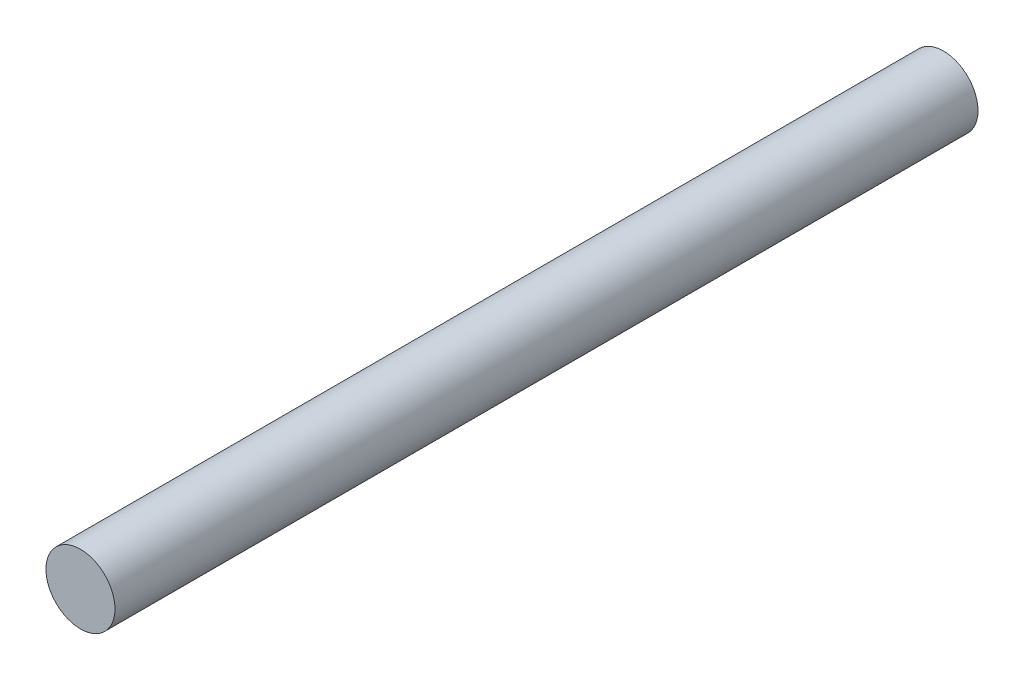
from build123d import *

# Parameters (mm, degrees)
IZIM1_R                     = 10
Y_KSEKLIK_EKSTR_ZYON1_DEPTH = 250


with BuildPart() as part:
    # izim1 → Y_kseklik-Ekstr_zyon1 (new body)
    with BuildSketch(Plane.XY):
        Circle(IZIM1_R)
    extrude(amount=Y_KSEKLIK_EKSTR_ZYON1_DEPTH)


solid = part.part
